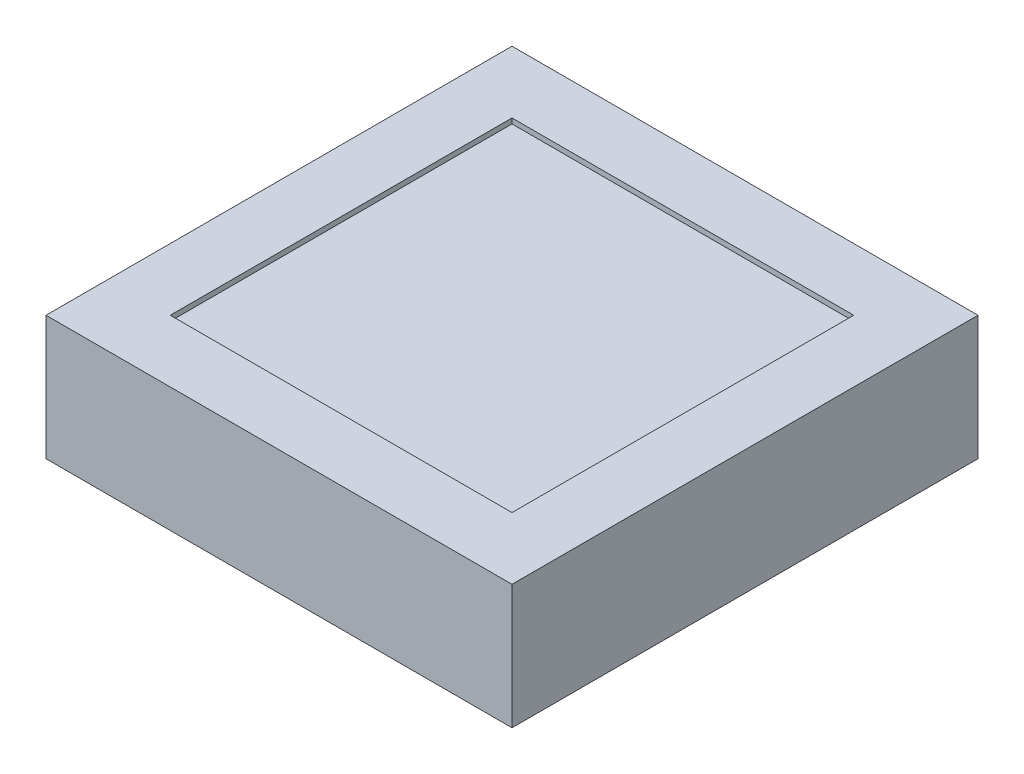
ISO-10303-21;
HEADER;
FILE_DESCRIPTION(('STEP AP214'),'2;1');
FILE_NAME('part.step','',(''),(''),'','','');
FILE_SCHEMA(('AUTOMOTIVE_DESIGN { 1 0 10303 214 1 1 1 1 }'));
ENDSEC;
DATA;
#1=APPLICATION_CONTEXT('core data for automotive mechanical design processes');
#2=APPLICATION_PROTOCOL_DEFINITION('international standard','automotive_design',2000,#1);
#3=PRODUCT_CONTEXT('',#1,'mechanical');
#4=PRODUCT('Part','Part','',(#3));
#5=PRODUCT_RELATED_PRODUCT_CATEGORY('part','',(#4));
#6=PRODUCT_DEFINITION_FORMATION('','',#4);
#7=PRODUCT_DEFINITION_CONTEXT('part definition',#1,'design');
#8=PRODUCT_DEFINITION('design','',#6,#7);
#9=PRODUCT_DEFINITION_SHAPE('','',#8);
#10=(LENGTH_UNIT() NAMED_UNIT(*) SI_UNIT(.MILLI.,.METRE.));
#11=(NAMED_UNIT(*) PLANE_ANGLE_UNIT() SI_UNIT($,.RADIAN.));
#12=(NAMED_UNIT(*) SI_UNIT($,.STERADIAN.) SOLID_ANGLE_UNIT());
#13=UNCERTAINTY_MEASURE_WITH_UNIT(LENGTH_MEASURE(1.E-05),#10,'distance_accuracy_value','');
#14=(GEOMETRIC_REPRESENTATION_CONTEXT(3) GLOBAL_UNCERTAINTY_ASSIGNED_CONTEXT((#13)) GLOBAL_UNIT_ASSIGNED_CONTEXT((#10,
#11,#12)) REPRESENTATION_CONTEXT('',''));
#15=CARTESIAN_POINT('',(0.,0.,0.));
#16=DIRECTION('',(0.,0.,1.));
#17=DIRECTION('',(1.,0.,0.));
#18=AXIS2_PLACEMENT_3D('',#15,#16,#17);
#19=CARTESIAN_POINT('',(144.143471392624,24.,145.254894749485));
#20=DIRECTION('',(-1.,0.,0.));
#21=DIRECTION('',(0.,0.,1.));
#22=AXIS2_PLACEMENT_3D('',#19,#20,#21);
#23=PLANE('',#22);
#24=DIRECTION('',(0.,0.,-1.));
#25=VECTOR('',#24,1.);
#26=CARTESIAN_POINT('',(144.143471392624,0.,145.254894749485));
#27=LINE('',#26,#25);
#28=CARTESIAN_POINT('',(144.143471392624,0.,145.254894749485));
#29=VERTEX_POINT('',#28);
#30=CARTESIAN_POINT('',(144.143471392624,0.,55.2548947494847));
#31=VERTEX_POINT('',#30);
#32=EDGE_CURVE('E158',#29,#31,#27,.T.);
#33=ORIENTED_EDGE('',*,*,#32,.T.);
#34=DIRECTION('',(0.,-1.,0.));
#35=VECTOR('',#34,1.);
#36=CARTESIAN_POINT('',(144.143471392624,24.,55.2548947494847));
#37=LINE('',#36,#35);
#38=CARTESIAN_POINT('',(144.143471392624,24.,55.2548947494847));
#39=VERTEX_POINT('',#38);
#40=EDGE_CURVE('E11',#39,#31,#37,.T.);
#41=ORIENTED_EDGE('',*,*,#40,.F.);
#42=DIRECTION('',(0.,0.,-1.));
#43=VECTOR('',#42,1.);
#44=CARTESIAN_POINT('',(144.143471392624,24.,145.254894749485));
#45=LINE('',#44,#43);
#46=CARTESIAN_POINT('',(144.143471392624,24.,145.254894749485));
#47=VERTEX_POINT('',#46);
#48=EDGE_CURVE('E164',#47,#39,#45,.T.);
#49=ORIENTED_EDGE('',*,*,#48,.F.);
#50=DIRECTION('',(0.,-1.,0.));
#51=VECTOR('',#50,1.);
#52=CARTESIAN_POINT('',(144.143471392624,24.,145.254894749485));
#53=LINE('',#52,#51);
#54=EDGE_CURVE('E174',#47,#29,#53,.T.);
#55=ORIENTED_EDGE('',*,*,#54,.T.);
#56=EDGE_LOOP('',(#33,#41,#49,#55));
#57=FACE_BOUND('',#56,.T.);
#58=ADVANCED_FACE('F39',(#57),#23,.F.);
#59=CARTESIAN_POINT('',(54.1434713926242,24.,55.2548947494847));
#60=DIRECTION('',(0.,0.,1.));
#61=DIRECTION('',(1.,0.,0.));
#62=AXIS2_PLACEMENT_3D('',#59,#60,#61);
#63=PLANE('',#62);
#64=DIRECTION('',(-1.,0.,0.));
#65=VECTOR('',#64,1.);
#66=CARTESIAN_POINT('',(54.1434713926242,0.,55.2548947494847));
#67=LINE('',#66,#65);
#68=CARTESIAN_POINT('',(54.1434713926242,0.,55.2548947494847));
#69=VERTEX_POINT('',#68);
#70=EDGE_CURVE('E178',#31,#69,#67,.T.);
#71=ORIENTED_EDGE('',*,*,#70,.T.);
#72=DIRECTION('',(0.,-1.,0.));
#73=VECTOR('',#72,1.);
#74=CARTESIAN_POINT('',(54.1434713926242,24.,55.2548947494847));
#75=LINE('',#74,#73);
#76=CARTESIAN_POINT('',(54.1434713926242,24.,55.2548947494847));
#77=VERTEX_POINT('',#76);
#78=EDGE_CURVE('E47',#77,#69,#75,.T.);
#79=ORIENTED_EDGE('',*,*,#78,.F.);
#80=DIRECTION('',(-1.,0.,0.));
#81=VECTOR('',#80,1.);
#82=CARTESIAN_POINT('',(54.1434713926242,24.,55.2548947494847));
#83=LINE('',#82,#81);
#84=EDGE_CURVE('E91',#39,#77,#83,.T.);
#85=ORIENTED_EDGE('',*,*,#84,.F.);
#86=ORIENTED_EDGE('',*,*,#40,.T.);
#87=EDGE_LOOP('',(#71,#79,#85,#86));
#88=FACE_BOUND('',#87,.T.);
#89=ADVANCED_FACE('F213',(#88),#63,.F.);
#90=CARTESIAN_POINT('',(54.1434713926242,24.,145.254894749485));
#91=DIRECTION('',(1.,0.,0.));
#92=DIRECTION('',(0.,0.,-1.));
#93=AXIS2_PLACEMENT_3D('',#90,#91,#92);
#94=PLANE('',#93);
#95=DIRECTION('',(0.,0.,1.));
#96=VECTOR('',#95,1.);
#97=CARTESIAN_POINT('',(54.1434713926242,0.,145.254894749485));
#98=LINE('',#97,#96);
#99=CARTESIAN_POINT('',(54.1434713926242,0.,145.254894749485));
#100=VERTEX_POINT('',#99);
#101=EDGE_CURVE('E181',#69,#100,#98,.T.);
#102=ORIENTED_EDGE('',*,*,#101,.T.);
#103=DIRECTION('',(0.,-1.,0.));
#104=VECTOR('',#103,1.);
#105=CARTESIAN_POINT('',(54.1434713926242,24.,145.254894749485));
#106=LINE('',#105,#104);
#107=CARTESIAN_POINT('',(54.1434713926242,24.,145.254894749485));
#108=VERTEX_POINT('',#107);
#109=EDGE_CURVE('E188',#108,#100,#106,.T.);
#110=ORIENTED_EDGE('',*,*,#109,.F.);
#111=DIRECTION('',(0.,0.,1.));
#112=VECTOR('',#111,1.);
#113=CARTESIAN_POINT('',(54.1434713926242,24.,145.254894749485));
#114=LINE('',#113,#112);
#115=EDGE_CURVE('E169',#77,#108,#114,.T.);
#116=ORIENTED_EDGE('',*,*,#115,.F.);
#117=ORIENTED_EDGE('',*,*,#78,.T.);
#118=EDGE_LOOP('',(#102,#110,#116,#117));
#119=FACE_BOUND('',#118,.T.);
#120=ADVANCED_FACE('F195',(#119),#94,.F.);
#121=CARTESIAN_POINT('',(54.1434713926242,24.,145.254894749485));
#122=DIRECTION('',(0.,0.,-1.));
#123=DIRECTION('',(-1.,0.,0.));
#124=AXIS2_PLACEMENT_3D('',#121,#122,#123);
#125=PLANE('',#124);
#126=DIRECTION('',(1.,0.,0.));
#127=VECTOR('',#126,1.);
#128=CARTESIAN_POINT('',(54.1434713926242,0.,145.254894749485));
#129=LINE('',#128,#127);
#130=EDGE_CURVE('E84',#100,#29,#129,.T.);
#131=ORIENTED_EDGE('',*,*,#130,.T.);
#132=ORIENTED_EDGE('',*,*,#54,.F.);
#133=DIRECTION('',(1.,0.,0.));
#134=VECTOR('',#133,1.);
#135=CARTESIAN_POINT('',(54.1434713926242,24.,145.254894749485));
#136=LINE('',#135,#134);
#137=EDGE_CURVE('E63',#108,#47,#136,.T.);
#138=ORIENTED_EDGE('',*,*,#137,.F.);
#139=ORIENTED_EDGE('',*,*,#109,.T.);
#140=EDGE_LOOP('',(#131,#132,#138,#139));
#141=FACE_BOUND('',#140,.T.);
#142=ADVANCED_FACE('F203',(#141),#125,.F.);
#143=CARTESIAN_POINT('',(0.,24.,0.));
#144=DIRECTION('',(0.,-1.,0.));
#145=DIRECTION('',(0.,0.,-1.));
#146=AXIS2_PLACEMENT_3D('',#143,#144,#145);
#147=PLANE('',#146);
#148=DIRECTION('',(-1.,0.,0.));
#149=VECTOR('',#148,1.);
#150=CARTESIAN_POINT('',(66.1434713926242,24.,67.2548947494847));
#151=LINE('',#150,#149);
#152=CARTESIAN_POINT('',(132.143471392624,24.,67.2548947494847));
#153=VERTEX_POINT('',#152);
#154=CARTESIAN_POINT('',(66.1434713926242,24.,67.2548947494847));
#155=VERTEX_POINT('',#154);
#156=EDGE_CURVE('E149',#153,#155,#151,.T.);
#157=ORIENTED_EDGE('',*,*,#156,.F.);
#158=DIRECTION('',(0.,0.,-1.));
#159=VECTOR('',#158,1.);
#160=CARTESIAN_POINT('',(132.143471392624,24.,133.254894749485));
#161=LINE('',#160,#159);
#162=CARTESIAN_POINT('',(132.143471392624,24.,133.254894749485));
#163=VERTEX_POINT('',#162);
#164=EDGE_CURVE('E54',#163,#153,#161,.T.);
#165=ORIENTED_EDGE('',*,*,#164,.F.);
#166=DIRECTION('',(1.,0.,0.));
#167=VECTOR('',#166,1.);
#168=CARTESIAN_POINT('',(66.1434713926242,24.,133.254894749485));
#169=LINE('',#168,#167);
#170=CARTESIAN_POINT('',(66.1434713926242,24.,133.254894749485));
#171=VERTEX_POINT('',#170);
#172=EDGE_CURVE('E136',#171,#163,#169,.T.);
#173=ORIENTED_EDGE('',*,*,#172,.F.);
#174=DIRECTION('',(0.,0.,1.));
#175=VECTOR('',#174,1.);
#176=CARTESIAN_POINT('',(66.1434713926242,24.,133.254894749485));
#177=LINE('',#176,#175);
#178=EDGE_CURVE('E140',#155,#171,#177,.T.);
#179=ORIENTED_EDGE('',*,*,#178,.F.);
#180=EDGE_LOOP('',(#157,#165,#173,#179));
#181=FACE_BOUND('',#180,.T.);
#182=ORIENTED_EDGE('',*,*,#48,.T.);
#183=ORIENTED_EDGE('',*,*,#84,.T.);
#184=ORIENTED_EDGE('',*,*,#115,.T.);
#185=ORIENTED_EDGE('',*,*,#137,.T.);
#186=EDGE_LOOP('',(#182,#183,#184,#185));
#187=FACE_BOUND('',#186,.T.);
#188=ADVANCED_FACE('F205',(#181,#187),#147,.F.);
#189=CARTESIAN_POINT('',(0.,0.,0.));
#190=DIRECTION('',(0.,-1.,0.));
#191=DIRECTION('',(0.,0.,-1.));
#192=AXIS2_PLACEMENT_3D('',#189,#190,#191);
#193=PLANE('',#192);
#194=ORIENTED_EDGE('',*,*,#32,.F.);
#195=ORIENTED_EDGE('',*,*,#130,.F.);
#196=ORIENTED_EDGE('',*,*,#101,.F.);
#197=ORIENTED_EDGE('',*,*,#70,.F.);
#198=EDGE_LOOP('',(#194,#195,#196,#197));
#199=FACE_BOUND('',#198,.T.);
#200=ADVANCED_FACE('F199',(#199),#193,.T.);
#201=CARTESIAN_POINT('',(132.143471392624,23.,133.254894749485));
#202=DIRECTION('',(1.,0.,0.));
#203=DIRECTION('',(0.,0.,-1.));
#204=AXIS2_PLACEMENT_3D('',#201,#202,#203);
#205=PLANE('',#204);
#206=ORIENTED_EDGE('',*,*,#164,.T.);
#207=DIRECTION('',(0.,1.,0.));
#208=VECTOR('',#207,1.);
#209=CARTESIAN_POINT('',(132.143471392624,23.,67.2548947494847));
#210=LINE('',#209,#208);
#211=CARTESIAN_POINT('',(132.143471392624,23.,67.2548947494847));
#212=VERTEX_POINT('',#211);
#213=EDGE_CURVE('E111',#212,#153,#210,.T.);
#214=ORIENTED_EDGE('',*,*,#213,.F.);
#215=DIRECTION('',(0.,0.,-1.));
#216=VECTOR('',#215,1.);
#217=CARTESIAN_POINT('',(132.143471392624,23.,133.254894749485));
#218=LINE('',#217,#216);
#219=CARTESIAN_POINT('',(132.143471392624,23.,133.254894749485));
#220=VERTEX_POINT('',#219);
#221=EDGE_CURVE('E115',#220,#212,#218,.T.);
#222=ORIENTED_EDGE('',*,*,#221,.F.);
#223=DIRECTION('',(0.,1.,0.));
#224=VECTOR('',#223,1.);
#225=CARTESIAN_POINT('',(132.143471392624,23.,133.254894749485));
#226=LINE('',#225,#224);
#227=EDGE_CURVE('E155',#220,#163,#226,.T.);
#228=ORIENTED_EDGE('',*,*,#227,.T.);
#229=EDGE_LOOP('',(#206,#214,#222,#228));
#230=FACE_BOUND('',#229,.T.);
#231=ADVANCED_FACE('F113',(#230),#205,.F.);
#232=CARTESIAN_POINT('',(66.1434713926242,23.,133.254894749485));
#233=DIRECTION('',(0.,0.,1.));
#234=DIRECTION('',(1.,0.,0.));
#235=AXIS2_PLACEMENT_3D('',#232,#233,#234);
#236=PLANE('',#235);
#237=ORIENTED_EDGE('',*,*,#172,.T.);
#238=ORIENTED_EDGE('',*,*,#227,.F.);
#239=DIRECTION('',(1.,0.,0.));
#240=VECTOR('',#239,1.);
#241=CARTESIAN_POINT('',(66.1434713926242,23.,133.254894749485));
#242=LINE('',#241,#240);
#243=CARTESIAN_POINT('',(66.1434713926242,23.,133.254894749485));
#244=VERTEX_POINT('',#243);
#245=EDGE_CURVE('E122',#244,#220,#242,.T.);
#246=ORIENTED_EDGE('',*,*,#245,.F.);
#247=DIRECTION('',(0.,1.,0.));
#248=VECTOR('',#247,1.);
#249=CARTESIAN_POINT('',(66.1434713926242,23.,133.254894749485));
#250=LINE('',#249,#248);
#251=EDGE_CURVE('E159',#244,#171,#250,.T.);
#252=ORIENTED_EDGE('',*,*,#251,.T.);
#253=EDGE_LOOP('',(#237,#238,#246,#252));
#254=FACE_BOUND('',#253,.T.);
#255=ADVANCED_FACE('F252',(#254),#236,.F.);
#256=CARTESIAN_POINT('',(66.1434713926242,23.,133.254894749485));
#257=DIRECTION('',(-1.,0.,0.));
#258=DIRECTION('',(0.,0.,1.));
#259=AXIS2_PLACEMENT_3D('',#256,#257,#258);
#260=PLANE('',#259);
#261=ORIENTED_EDGE('',*,*,#178,.T.);
#262=ORIENTED_EDGE('',*,*,#251,.F.);
#263=DIRECTION('',(0.,0.,1.));
#264=VECTOR('',#263,1.);
#265=CARTESIAN_POINT('',(66.1434713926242,23.,133.254894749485));
#266=LINE('',#265,#264);
#267=CARTESIAN_POINT('',(66.1434713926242,23.,67.2548947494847));
#268=VERTEX_POINT('',#267);
#269=EDGE_CURVE('E131',#268,#244,#266,.T.);
#270=ORIENTED_EDGE('',*,*,#269,.F.);
#271=DIRECTION('',(0.,1.,0.));
#272=VECTOR('',#271,1.);
#273=CARTESIAN_POINT('',(66.1434713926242,23.,67.2548947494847));
#274=LINE('',#273,#272);
#275=EDGE_CURVE('E121',#268,#155,#274,.T.);
#276=ORIENTED_EDGE('',*,*,#275,.T.);
#277=EDGE_LOOP('',(#261,#262,#270,#276));
#278=FACE_BOUND('',#277,.T.);
#279=ADVANCED_FACE('F261',(#278),#260,.F.);
#280=CARTESIAN_POINT('',(66.1434713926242,23.,67.2548947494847));
#281=DIRECTION('',(0.,0.,-1.));
#282=DIRECTION('',(-1.,0.,0.));
#283=AXIS2_PLACEMENT_3D('',#280,#281,#282);
#284=PLANE('',#283);
#285=ORIENTED_EDGE('',*,*,#156,.T.);
#286=ORIENTED_EDGE('',*,*,#275,.F.);
#287=DIRECTION('',(-1.,0.,0.));
#288=VECTOR('',#287,1.);
#289=CARTESIAN_POINT('',(66.1434713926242,23.,67.2548947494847));
#290=LINE('',#289,#288);
#291=EDGE_CURVE('E125',#212,#268,#290,.T.);
#292=ORIENTED_EDGE('',*,*,#291,.F.);
#293=ORIENTED_EDGE('',*,*,#213,.T.);
#294=EDGE_LOOP('',(#285,#286,#292,#293));
#295=FACE_BOUND('',#294,.T.);
#296=ADVANCED_FACE('F126',(#295),#284,.F.);
#297=CARTESIAN_POINT('',(0.,23.,0.));
#298=DIRECTION('',(0.,-1.,0.));
#299=DIRECTION('',(0.,0.,-1.));
#300=AXIS2_PLACEMENT_3D('',#297,#298,#299);
#301=PLANE('',#300);
#302=ORIENTED_EDGE('',*,*,#221,.T.);
#303=ORIENTED_EDGE('',*,*,#291,.T.);
#304=ORIENTED_EDGE('',*,*,#269,.T.);
#305=ORIENTED_EDGE('',*,*,#245,.T.);
#306=EDGE_LOOP('',(#302,#303,#304,#305));
#307=FACE_BOUND('',#306,.T.);
#308=ADVANCED_FACE('F133',(#307),#301,.F.);
#309=CLOSED_SHELL('',(#58,#89,#120,#142,#188,#200,#231,#255,#279,#296,#308));
#310=MANIFOLD_SOLID_BREP('B2',#309);
#311=ADVANCED_BREP_SHAPE_REPRESENTATION('',(#18,#310),#14);
#312=SHAPE_DEFINITION_REPRESENTATION(#9,#311);
ENDSEC;
END-ISO-10303-21;
